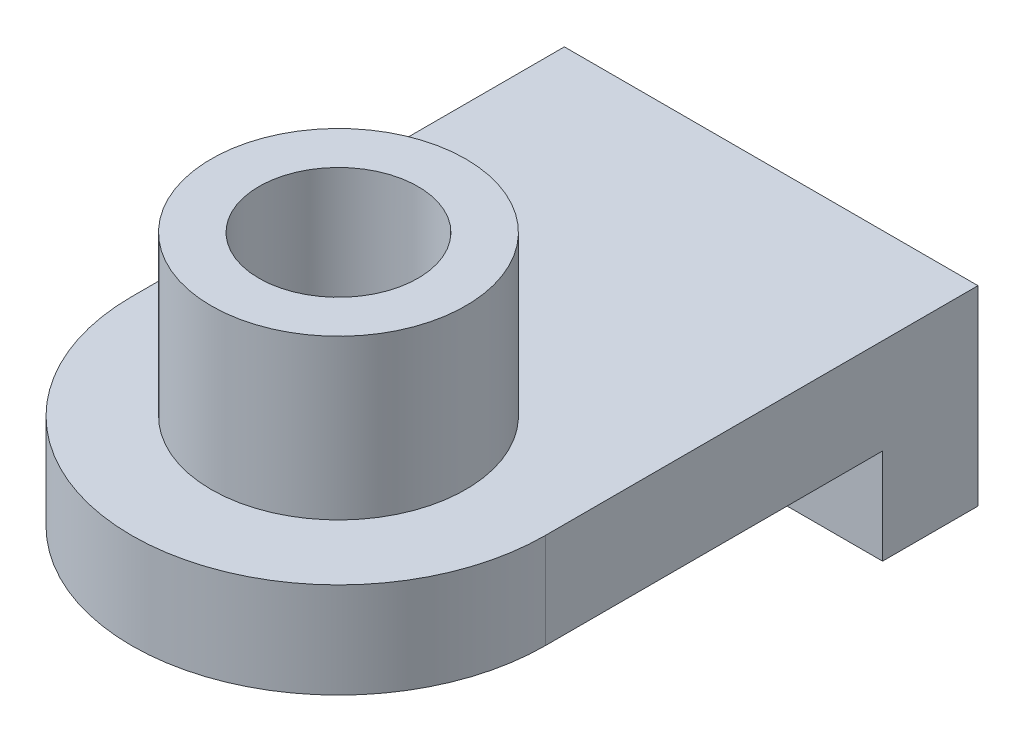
from build123d import *

# Parameters (mm, degrees)
EXTRUDE1_DEPTH     = 15
SKETCH2_W          = 65
SKETCH2_H          = 15
EXTRUDE2_DEPTH     = 15
SKETCH3_R          = 20
EXTRUDE3_DEPTH     = 25
SKETCH4_R          = 12.5
CUT_EXTRUDE1_DEPTH = 94.301929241


with BuildPart() as part:
    # Sketch1 → Extrude1 (new body)
    with BuildSketch(Plane(origin=(0, 0, 0), x_dir=(1, 0, 0), z_dir=(0, 1, 0))):
        with BuildLine():
            Line((-32.5, 0), (-32.5, 68))
            Line((-32.5, 68), (32.5, 68))
            Line((32.5, 68), (32.5, 0))
            ThreePointArc((32.5, 0), (0, -32.5), (-32.5, 0))
        make_face()
    extrude(amount=EXTRUDE1_DEPTH)

    # Sketch2 → Extrude2 (add)
    with BuildSketch(Plane.XZ):
        with Locations((0, -60.5)):
            Rectangle(SKETCH2_W, SKETCH2_H)
    extrude(amount=EXTRUDE2_DEPTH)

    # Sketch3 → Extrude3 (add)
    with BuildSketch(Plane(origin=(0, 15, 0), x_dir=(-1, 0, 0), z_dir=(0, 1, 0))):
        with Locations(Location((0, 0, 0), (0, 0, 270))):
            Circle(SKETCH3_R)
    extrude(amount=EXTRUDE3_DEPTH)

    # Sketch4 → Cut-Extrude1 (cut, through all)
    with BuildSketch(Plane(origin=(0, 40, 0), x_dir=(-1, 0, 0), z_dir=(0, 1, 0))):
        with Locations(Location((0, 0, 0), (0, 0, 90))):
            Circle(SKETCH4_R)
    extrude(amount=-CUT_EXTRUDE1_DEPTH, mode=Mode.SUBTRACT)


solid = part.part
